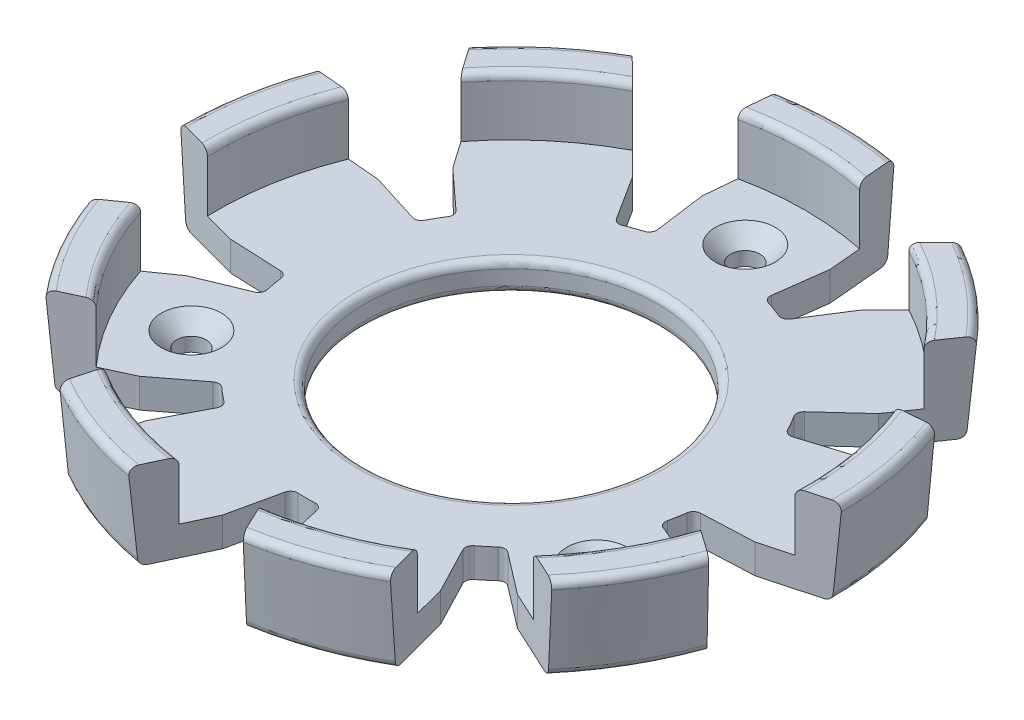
from build123d import *

# Parameters (mm, degrees)
EXTRUSION1_DEPTH                             = 2
EXTRUSION13_START                            = 4
EXTRUSION13_DEPTH                            = 4
D_POUILLE1_ANGLE                             = 5.000000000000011
CONG_75_R                                    = 0.5
R_P_TITION_CIRCULAIRE1_COUNT                 = 9
D_POUILLE1_OF_R_P_TITION_CIRCULAIRE1_2_ANGLE = 5.000000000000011
D_POUILLE1_OF_R_P_TITION_CIRCULAIRE1_3_ANGLE = 5.000000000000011
D_POUILLE1_OF_R_P_TITION_CIRCULAIRE1_4_ANGLE = 5.000000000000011
D_POUILLE1_OF_R_P_TITION_CIRCULAIRE1_5_ANGLE = 5.000000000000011
D_POUILLE1_OF_R_P_TITION_CIRCULAIRE1_6_ANGLE = 5.000000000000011
D_POUILLE1_OF_R_P_TITION_CIRCULAIRE1_7_ANGLE = 5.000000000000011
D_POUILLE1_OF_R_P_TITION_CIRCULAIRE1_8_ANGLE = 5.000000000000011
D_POUILLE1_OF_R_P_TITION_CIRCULAIRE1_9_ANGLE = 5.000000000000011
CONG_75_OF_R_P_TITION_CIRCULAIRE1_R          = 0.5
EXTRUSION11_REACH                            = 34.473
ESQUISSE11_R                                 = 10
CONG_76_R                                    = 0.5
R_P_TITION_CIRCULAIRE2_COUNT                 = 3


with BuildPart() as part:
    # Esquisse1 → Extrusion1 (new body)
    with BuildSketch(Plane(origin=(0, 2, 0), x_dir=(-1, 0, 0), z_dir=(0, 1, 0))):
        with BuildLine():
            Line((-3.8363587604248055, -13.464113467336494), (-4.358463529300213, -17.42989291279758))
            Line((-4.358463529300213, -17.42989291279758), (-3.9703646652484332, -21.727700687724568))
            ThreePointArc((-3.9703646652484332, -21.727700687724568), (7.04408e-12, -22.08748), (3.9703646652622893, -21.727700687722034))
            Line((3.9703646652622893, -21.727700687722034), (4.35846352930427, -17.429892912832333))
            Line((4.35846352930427, -17.429892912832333), (3.8363587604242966, -13.46411346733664))
            ThreePointArc((3.8363587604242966, -13.46411346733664), (4.315076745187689, -13.318412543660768), (4.788282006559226, -13.155696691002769))
            Line((4.788282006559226, -13.155696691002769), (0, 0))
            Line((0, 0), (-4.788282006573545, -13.155696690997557))
            ThreePointArc((-4.788282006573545, -13.155696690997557), (-4.315076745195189, -13.318412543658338), (-3.8363587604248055, -13.464113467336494))
        make_face()
    extrusion1 = extrude(amount=-EXTRUSION1_DEPTH)

    # Esquisse18 → Extrusion13 (add)
    with BuildSketch(Plane(origin=(0, 2, 0), x_dir=(1, 0, 0), z_dir=(0, 1, 0)).offset(EXTRUSION13_START)):
        with BuildLine():
            Line((3.9703646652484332, 21.727700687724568), (4.157760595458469, 19.65247769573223))
            ThreePointArc((4.157760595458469, 19.65247769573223), (-5.4805e-12, 20.08748), (-4.1577605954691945, 19.65247769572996))
            Line((-4.1577605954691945, 19.65247769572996), (-3.9703646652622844, 21.727700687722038))
            ThreePointArc((-3.9703646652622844, 21.727700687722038), (-7.04137e-12, 22.08748), (3.9703646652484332, 21.727700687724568))
        make_face()
    extrusion13 = extrude(amount=-EXTRUSION13_DEPTH)

    # D_pouille1
    d_pouille1_faces = [part.faces().sort_by_distance(p)[0] for p in [
        (-7.01594e-12, 3, -22.08748),
    ]]
    draft(d_pouille1_faces, Plane(origin=(0, 0, 0), x_dir=(0, 0, -1), z_dir=(0, -1, 0)), D_POUILLE1_ANGLE)

    # Cong_75
    cong_75_edges = [part.edges().sort_by_distance(p)[0] for p in [
        (3.836358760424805, 1, -13.464113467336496),
        (-7.04214e-12, 0, -22.08748),
        (-3.8363587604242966, 1, -13.464113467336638),
        (-5.48139e-12, 6, -20.087480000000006),
        (-7.45559e-12, 6, -22.612411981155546),
    ]]
    fillet(cong_75_edges, radius=CONG_75_R)

    # R_p_tition circulaire1: Extrusion1, Extrusion13 ×9 about axis
    r_p_tition_circulaire1_axis = Axis((1.3e-16, 0, -1.2e-16), (0, 1, 0))
    add([extrusion1.rotate(r_p_tition_circulaire1_axis, i * 360 / R_P_TITION_CIRCULAIRE1_COUNT) for i in range(1, R_P_TITION_CIRCULAIRE1_COUNT)])
    add([extrusion13.rotate(r_p_tition_circulaire1_axis, i * 360 / R_P_TITION_CIRCULAIRE1_COUNT) for i in range(1, R_P_TITION_CIRCULAIRE1_COUNT)])

    # D_pouille1 of R_p_tition circulaire1 2
    d_pouille1_of_r_p_tition_circulaire1_2_faces = [part.faces().sort_by_distance(p)[0] for p in [
        (-14.197558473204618, 3, -16.919991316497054),
    ]]
    draft(d_pouille1_of_r_p_tition_circulaire1_2_faces, Plane(origin=(1.1e-16, 0, 5e-17), x_dir=(-0.6427876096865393, 0, -0.766044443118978), z_dir=(0, -1, 0)), D_POUILLE1_OF_R_P_TITION_CIRCULAIRE1_2_ANGLE)

    # D_pouille1 of R_p_tition circulaire1 3
    d_pouille1_of_r_p_tition_circulaire1_3_faces = [part.faces().sort_by_distance(p)[0] for p in [
        (-21.7519215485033, 3, -3.835450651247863),
    ]]
    draft(d_pouille1_of_r_p_tition_circulaire1_3_faces, Plane(origin=(2.3e-16, 0, 2e-17), x_dir=(-0.984807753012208, 0, -0.17364817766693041), z_dir=(0, -1, 0)), D_POUILLE1_OF_R_P_TITION_CIRCULAIRE1_3_ANGLE)

    # D_pouille1 of R_p_tition circulaire1 4
    d_pouille1_of_r_p_tition_circulaire1_4_faces = [part.faces().sort_by_distance(p)[0] for p in [
        (-19.128318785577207, 3, 11.04374000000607),
    ]]
    draft(d_pouille1_of_r_p_tition_circulaire1_4_faces, Plane(origin=(3e-16, 0, -7e-17), x_dir=(-0.8660254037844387, 0, 0.4999999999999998), z_dir=(0, -1, 0)), D_POUILLE1_OF_R_P_TITION_CIRCULAIRE1_4_ANGLE)

    # D_pouille1 of R_p_tition circulaire1 5
    d_pouille1_of_r_p_tition_circulaire1_5_faces = [part.faces().sort_by_distance(p)[0] for p in [
        (-7.554363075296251, 3, 20.75544196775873),
    ]]
    draft(d_pouille1_of_r_p_tition_circulaire1_5_faces, Plane(origin=(2.9e-16, 0, -2e-16), x_dir=(-0.3420201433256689, 0, 0.9396926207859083), z_dir=(0, -1, 0)), D_POUILLE1_OF_R_P_TITION_CIRCULAIRE1_5_ANGLE)

    # D_pouille1 of R_p_tition circulaire1 6
    d_pouille1_of_r_p_tition_circulaire1_6_faces = [part.faces().sort_by_distance(p)[0] for p in [
        (7.554363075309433, 3, 20.75544196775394),
    ]]
    draft(d_pouille1_of_r_p_tition_circulaire1_6_faces, Plane(origin=(2.1e-16, 0, -2.8e-16), x_dir=(0.34202014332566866, 0, 0.9396926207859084), z_dir=(0, -1, 0)), D_POUILLE1_OF_R_P_TITION_CIRCULAIRE1_6_ANGLE)

    # D_pouille1 of R_p_tition circulaire1 7
    d_pouille1_of_r_p_tition_circulaire1_7_faces = [part.faces().sort_by_distance(p)[0] for p in [
        (19.128318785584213, 3, 11.043739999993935),
    ]]
    draft(d_pouille1_of_r_p_tition_circulaire1_7_faces, Plane(origin=(8e-17, 0, -3e-16), x_dir=(0.8660254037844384, 0, 0.5000000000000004), z_dir=(0, -1, 0)), D_POUILLE1_OF_R_P_TITION_CIRCULAIRE1_7_ANGLE)

    # D_pouille1 of R_p_tition circulaire1 8
    d_pouille1_of_r_p_tition_circulaire1_8_faces = [part.faces().sort_by_distance(p)[0] for p in [
        (21.751921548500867, 3, -3.835450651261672),
    ]]
    draft(d_pouille1_of_r_p_tition_circulaire1_8_faces, Plane(origin=(-2e-17, 0, -2.3e-16), x_dir=(0.9848077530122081, 0, -0.17364817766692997), z_dir=(0, -1, 0)), D_POUILLE1_OF_R_P_TITION_CIRCULAIRE1_8_ANGLE)

    # D_pouille1 of R_p_tition circulaire1 9
    d_pouille1_of_r_p_tition_circulaire1_9_faces = [part.faces().sort_by_distance(p)[0] for p in [
        (14.197558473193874, 3, -16.919991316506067),
    ]]
    draft(d_pouille1_of_r_p_tition_circulaire1_9_faces, Plane(origin=(-5e-17, 0, -1.1e-16), x_dir=(0.6427876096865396, 0, -0.7660444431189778), z_dir=(0, -1, 0)), D_POUILLE1_OF_R_P_TITION_CIRCULAIRE1_9_ANGLE)

    # Cong_75 of R_p_tition circulaire1
    cong_75_of_r_p_tition_circulaire1_edges = [part.edges().sort_by_distance(p)[0] for p in [
        (-5.715744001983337, 1, -12.780073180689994),
        (-14.197558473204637, 0, -16.919991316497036),
        (-11.593386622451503, 1, -7.848145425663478),
        (-12.911983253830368, 6, -15.387902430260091),
        (-14.534978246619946, 6, -17.322112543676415),
        (-12.593386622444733, 1, -6.11609461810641),
        (-21.751921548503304, 0, -3.835450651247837),
        (-13.925740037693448, 1, 1.440057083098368),
        (-19.782306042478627, 6, -3.4881542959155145),
        (-22.268878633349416, 6, -3.926604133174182),
        (-13.578443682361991, 1, 3.409672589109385),
        (-19.128318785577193, 0, 11.043740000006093),
        (-9.742084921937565, 1, 10.054440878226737),
        (-17.396267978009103, 6, 10.043740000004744),
        (-19.582923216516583, 6, 11.306205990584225),
        (-8.209996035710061, 1, 11.340016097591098),
        (-7.5543630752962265, 0, 20.755441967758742),
        (-0.9999999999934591, 1, 13.964240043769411),
        (-6.870322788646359, 6, 18.8760567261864),
        (-7.733900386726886, 6, 21.24871667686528),
        (0.9999999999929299, 1, 13.964240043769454),
        (7.554363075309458, 0, 20.755441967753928),
        (8.20999603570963, 1, 11.340016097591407),
        (6.870322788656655, 6, 18.87605672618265),
        (7.733900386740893, 6, 21.24871667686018),
        (9.74208492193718, 1, 10.054440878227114),
        (19.128318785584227, 0, 11.043739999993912),
        (13.578443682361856, 1, 3.409672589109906),
        (17.396267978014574, 6, 10.043739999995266),
        (19.58292321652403, 6, 11.306205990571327),
        (13.925740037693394, 1, 1.4400570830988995),
        (21.751921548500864, 0, -3.835450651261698),
        (12.593386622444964, 1, -6.116094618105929),
        (19.782306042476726, 6, -3.488154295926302),
        (22.268878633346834, 6, -3.9266041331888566),
        (11.593386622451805, 1, -7.848145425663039),
        (14.197558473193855, 0, -16.919991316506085),
        (5.715744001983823, 1, -12.780073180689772),
        (12.911983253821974, 6, -15.38790243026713),
        (14.534978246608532, 6, -17.322112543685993),
    ]]
    fillet(cong_75_of_r_p_tition_circulaire1_edges, radius=CONG_75_OF_R_P_TITION_CIRCULAIRE1_R)

    # Esquisse11 → Extrusion11 (cut, up to next)
    with BuildSketch(Plane.XZ, mode=Mode.PRIVATE) as extrusion11_sk1:
        with Locations(Location((0, 0, 0), (0, 0, 90))):
            Circle(ESQUISSE11_R)
    extrusion11_tool1 = extrude(extrusion11_sk1.sketch, amount=-EXTRUSION11_REACH, mode=Mode.PRIVATE) & part.part
    add(extrusion11_tool1.solids().sort_by_distance((0, 0, 0))[0], mode=Mode.SUBTRACT)

    # Esquisse12 → Per_age1 (revolve, cut)
    with BuildSketch(Plane(origin=(13.8564064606, 2, 8), x_dir=(0, 0, 1), z_dir=(1, 0, 0))):
        Polygon((0, 0), (0, 2.0010000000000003), (1, 2.0009999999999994), (1.000000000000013, 1.0540000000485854), (2.0540000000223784, -2.6e-15), align=None)
    per_age1 = revolve(axis=Axis((13.8564064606, 8.445314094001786, 8), (0, -1, 0)), mode=Mode.SUBTRACT)

    # Cong_76
    cong_76_edges = [part.edges().sort_by_distance(p)[0] for p in [
        (-1.84e-15, 2, -10),
        (-1.84e-15, 0, -10),
    ]]
    fillet(cong_76_edges, radius=CONG_76_R)

    # R_p_tition circulaire2: Per_age1 ×3 about axis
    r_p_tition_circulaire2_axis = Axis((-1.12e-15, 0, -7e-17), (0, 1, 0))
    for i in range(1, R_P_TITION_CIRCULAIRE2_COUNT):
        add(per_age1.rotate(r_p_tition_circulaire2_axis, i * 360 / R_P_TITION_CIRCULAIRE2_COUNT), mode=Mode.SUBTRACT)

    # Esquisse14 → Per_age2 (revolve, cut)
    with BuildSketch(Plane(origin=(-13.8564064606, 2, 8), x_dir=(0, 0, 1), z_dir=(1, 0, 0))):
        Polygon((0, 0), (0, 2.0309961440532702), (1, 2.0309961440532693), (1.000000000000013, 1.0540000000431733), (2.0540000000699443, -2.6e-15), align=None)
    revolve(axis=Axis((-13.8564064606, 8.445314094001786, 8), (0, -1, 0)), mode=Mode.SUBTRACT)

    # Esquisse16 → Per_age3 (revolve, cut)
    with BuildSketch(Plane(origin=(4.3e-16, 2, -16), x_dir=(0, 0, 1), z_dir=(1, 0, 0))):
        Polygon((0, 0), (0, 2.0309961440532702), (1.0000000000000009, 2.0309961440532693), (1.000000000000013, 1.054000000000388), (2.0540000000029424, -2.6e-15), align=None)
    revolve(axis=Axis((4.3e-16, 8.445314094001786, -16), (0, -1, 0)), mode=Mode.SUBTRACT)


solid = part.part
